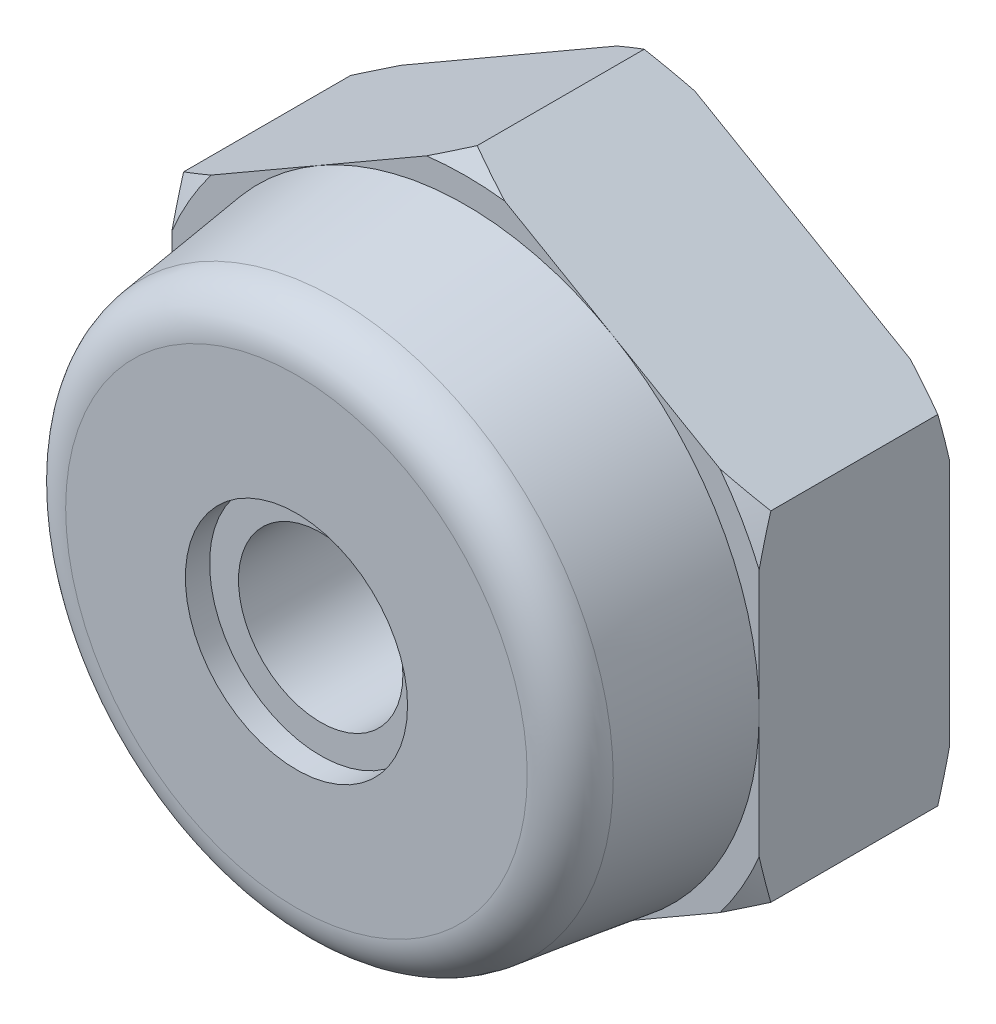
from build123d import *

# Parameters (mm, degrees)
BASENUTSKE_R  = 0.889
BASENUT_DEPTH = 2.0574


with BuildPart() as part:
    # BaseNutSke → BaseNut (new body)
    with BuildSketch(Plane.XY):
        Polygon((3.175, -1.833087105), (3.175, 1.833087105), (0, 3.666174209), (-3.175, 1.833087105), (-3.175, -1.833087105), (0, -3.666174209), align=None)
        Circle(BASENUTSKE_R, mode=Mode.SUBTRACT)
    extrude(amount=-BASENUT_DEPTH)

    # TorqEleSke → TorqueElement (revolve)
    with BuildSketch(Plane(origin=(0, 0, 0), x_dir=(0, 0, -1), z_dir=(0, 1, 0)), mode=Mode.PRIVATE) as torqueelement_sk:
        with BuildLine():
            Line((-1.566672, 1.20142), (-1.566672, 0.889))
            Line((-1.566672, 0.889), (0, 0.889))
            Line((0, 0.889), (0, 3.175))
            Line((0, 3.175), (-1.394063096, 2.991468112))
            ThreePointArc((-1.394063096, 2.991468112), (-1.704719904, 2.825418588), (-1.8288, 2.495745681))
            Line((-1.8288, 2.495745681), (-1.8288, 1.20142))
            Line((-1.8288, 1.20142), (-1.566672, 1.20142))
        make_face()
    revolve(torqueelement_sk.sketch.rotate(Axis((0, 0, 9.480888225), (0, 0, -1)), 180), axis=Axis((0, 0, 9.480888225), (0, 0, -1)))

    # Sketch3 → DoubleChamfer (revolve, cut)
    with BuildSketch(Plane(origin=(0, 0, 0), x_dir=(0, 0, -1), z_dir=(1, 0, 0))):
        Polygon((2.0574, 3.447734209), (1.931283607, 3.666174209), (2.0574, 3.666174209), align=None)
        Polygon((0, 3.666174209), (0, 3.447734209), (0.126116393, 3.666174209), align=None)
    revolve(axis=Axis((0, 0, 0), (0, 0, -1)), mode=Mode.SUBTRACT)

    # ThdSchSke → ThreadSchematic (revolve, cut)
    with BuildSketch(Plane(origin=(0, 0, 0), x_dir=(1, 0, 0), z_dir=(0, 1, 0)), mode=Mode.PRIVATE) as threadschematic_sk:
        Polygon((-1.0922, 2.0574), (-0.889, 2.174717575), (-0.889, 1.940082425), align=None)
    revolve(threadschematic_sk.sketch.rotate(Axis((0, 0, 1.481463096), (0, 0, 1)), 180), axis=Axis((0, 0, 1.481463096), (0, 0, 1)), mode=Mode.SUBTRACT)


solid = part.part
